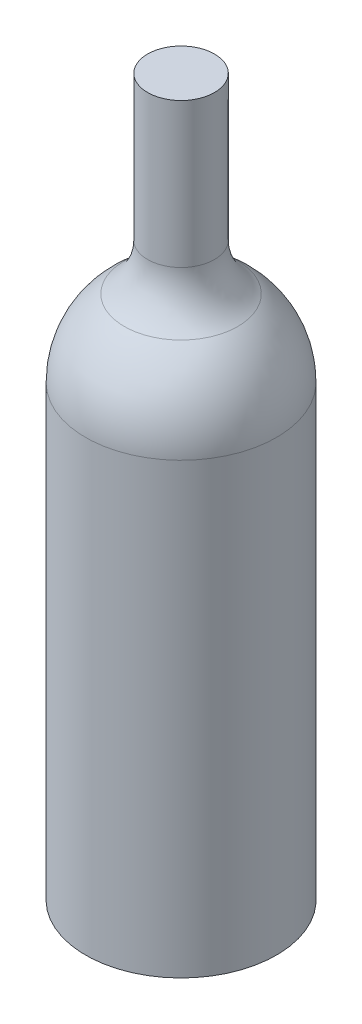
ISO-10303-21;
HEADER;
FILE_DESCRIPTION(('STEP AP214'),'2;1');
FILE_NAME('part.step','',(''),(''),'','','');
FILE_SCHEMA(('AUTOMOTIVE_DESIGN { 1 0 10303 214 1 1 1 1 }'));
ENDSEC;
DATA;
#1=APPLICATION_CONTEXT('core data for automotive mechanical design processes');
#2=APPLICATION_PROTOCOL_DEFINITION('international standard','automotive_design',2000,#1);
#3=PRODUCT_CONTEXT('',#1,'mechanical');
#4=PRODUCT('Part','Part','',(#3));
#5=PRODUCT_RELATED_PRODUCT_CATEGORY('part','',(#4));
#6=PRODUCT_DEFINITION_FORMATION('','',#4);
#7=PRODUCT_DEFINITION_CONTEXT('part definition',#1,'design');
#8=PRODUCT_DEFINITION('design','',#6,#7);
#9=PRODUCT_DEFINITION_SHAPE('','',#8);
#10=(LENGTH_UNIT() NAMED_UNIT(*) SI_UNIT(.MILLI.,.METRE.));
#11=(NAMED_UNIT(*) PLANE_ANGLE_UNIT() SI_UNIT($,.RADIAN.));
#12=(NAMED_UNIT(*) SI_UNIT($,.STERADIAN.) SOLID_ANGLE_UNIT());
#13=UNCERTAINTY_MEASURE_WITH_UNIT(LENGTH_MEASURE(1.E-05),#10,'distance_accuracy_value','');
#14=(GEOMETRIC_REPRESENTATION_CONTEXT(3) GLOBAL_UNCERTAINTY_ASSIGNED_CONTEXT((#13)) GLOBAL_UNIT_ASSIGNED_CONTEXT((#10,
#11,#12)) REPRESENTATION_CONTEXT('',''));
#15=CARTESIAN_POINT('',(0.,0.,0.));
#16=DIRECTION('',(0.,0.,1.));
#17=DIRECTION('',(1.,0.,0.));
#18=AXIS2_PLACEMENT_3D('',#15,#16,#17);
#19=CARTESIAN_POINT('',(40.,0.,0.));
#20=DIRECTION('',(0.,-1.,0.));
#21=DIRECTION('',(0.,0.,-1.));
#22=AXIS2_PLACEMENT_3D('',#19,#20,#21);
#23=PLANE('',#22);
#24=CARTESIAN_POINT('',(0.,0.,0.));
#25=DIRECTION('',(0.,-1.,0.));
#26=DIRECTION('',(0.,0.,-1.));
#27=AXIS2_PLACEMENT_3D('',#24,#25,#26);
#28=CIRCLE('',#27,40.);
#29=CARTESIAN_POINT('',(0.,0.,-40.));
#30=VERTEX_POINT('',#29);
#31=EDGE_CURVE('E10',#30,#30,#28,.T.);
#32=ORIENTED_EDGE('',*,*,#31,.T.);
#33=EDGE_LOOP('',(#32));
#34=FACE_BOUND('',#33,.T.);
#35=ADVANCED_FACE('F346',(#34),#23,.T.);
#36=CARTESIAN_POINT('',(0.,0.,0.));
#37=DIRECTION('',(0.,-1.,0.));
#38=DIRECTION('',(0.,0.,-1.));
#39=AXIS2_PLACEMENT_3D('',#36,#37,#38);
#40=CYLINDRICAL_SURFACE('',#39,40.);
#41=CARTESIAN_POINT('',(0.,187.839329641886,0.));
#42=DIRECTION('',(0.,-1.,0.));
#43=DIRECTION('',(0.,0.,-1.));
#44=AXIS2_PLACEMENT_3D('',#41,#42,#43);
#45=CIRCLE('',#44,40.);
#46=CARTESIAN_POINT('',(0.,187.839329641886,-40.));
#47=VERTEX_POINT('',#46);
#48=EDGE_CURVE('E352',#47,#47,#45,.T.);
#49=ORIENTED_EDGE('',*,*,#48,.T.);
#50=EDGE_LOOP('',(#49));
#51=FACE_BOUND('',#50,.T.);
#52=ORIENTED_EDGE('',*,*,#31,.F.);
#53=EDGE_LOOP('',(#52));
#54=FACE_BOUND('',#53,.T.);
#55=ADVANCED_FACE('F381',(#51,#54),#40,.T.);
#56=CARTESIAN_POINT('',(0.,187.839329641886,0.));
#57=DIRECTION('',(0.,-1.,0.));
#58=DIRECTION('',(1.,0.,0.));
#59=AXIS2_PLACEMENT_3D('',#56,#57,#58);
#60=SPHERICAL_SURFACE('',#59,40.);
#61=CARTESIAN_POINT('',(0.,220.,0.));
#62=DIRECTION('',(0.,-1.,0.));
#63=DIRECTION('',(0.,0.,-1.));
#64=AXIS2_PLACEMENT_3D('',#61,#62,#63);
#65=CIRCLE('',#64,23.7842654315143);
#66=CARTESIAN_POINT('',(0.,220.,-23.7842654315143));
#67=VERTEX_POINT('',#66);
#68=EDGE_CURVE('E356',#67,#67,#65,.T.);
#69=ORIENTED_EDGE('',*,*,#68,.T.);
#70=EDGE_LOOP('',(#69));
#71=FACE_BOUND('',#70,.T.);
#72=ORIENTED_EDGE('',*,*,#48,.F.);
#73=EDGE_LOOP('',(#72));
#74=FACE_BOUND('',#73,.T.);
#75=ADVANCED_FACE('F385',(#71,#74),#60,.T.);
#76=CARTESIAN_POINT('',(0.,239.405136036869,0.));
#77=DIRECTION('',(0.,-1.,0.));
#78=DIRECTION('',(0.,0.,-1.));
#79=AXIS2_PLACEMENT_3D('',#76,#77,#78);
#80=TOROIDAL_SURFACE('',#79,38.13523825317,24.13523825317);
#81=CARTESIAN_POINT('',(0.,239.405136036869,0.));
#82=DIRECTION('',(0.,-1.,0.));
#83=DIRECTION('',(0.,0.,-1.));
#84=AXIS2_PLACEMENT_3D('',#81,#82,#83);
#85=CIRCLE('',#84,14.);
#86=CARTESIAN_POINT('',(0.,239.405136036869,-14.));
#87=VERTEX_POINT('',#86);
#88=EDGE_CURVE('E360',#87,#87,#85,.T.);
#89=ORIENTED_EDGE('',*,*,#88,.T.);
#90=EDGE_LOOP('',(#89));
#91=FACE_BOUND('',#90,.T.);
#92=ORIENTED_EDGE('',*,*,#68,.F.);
#93=EDGE_LOOP('',(#92));
#94=FACE_BOUND('',#93,.T.);
#95=ADVANCED_FACE('F378',(#91,#94),#80,.F.);
#96=CARTESIAN_POINT('',(0.,0.,0.));
#97=DIRECTION('',(0.,-1.,0.));
#98=DIRECTION('',(0.,0.,-1.));
#99=AXIS2_PLACEMENT_3D('',#96,#97,#98);
#100=CYLINDRICAL_SURFACE('',#99,14.);
#101=CARTESIAN_POINT('',(0.,300.,0.));
#102=DIRECTION('',(0.,-1.,0.));
#103=DIRECTION('',(0.,0.,-1.));
#104=AXIS2_PLACEMENT_3D('',#101,#102,#103);
#105=CIRCLE('',#104,14.);
#106=CARTESIAN_POINT('',(0.,300.,-14.));
#107=VERTEX_POINT('',#106);
#108=EDGE_CURVE('E365',#107,#107,#105,.T.);
#109=ORIENTED_EDGE('',*,*,#108,.T.);
#110=EDGE_LOOP('',(#109));
#111=FACE_BOUND('',#110,.T.);
#112=ORIENTED_EDGE('',*,*,#88,.F.);
#113=EDGE_LOOP('',(#112));
#114=FACE_BOUND('',#113,.T.);
#115=ADVANCED_FACE('F369',(#111,#114),#100,.T.);
#116=CARTESIAN_POINT('',(0.,300.,0.));
#117=DIRECTION('',(0.,1.,0.));
#118=DIRECTION('',(0.,0.,1.));
#119=AXIS2_PLACEMENT_3D('',#116,#117,#118);
#120=PLANE('',#119);
#121=ORIENTED_EDGE('',*,*,#108,.F.);
#122=EDGE_LOOP('',(#121));
#123=FACE_BOUND('',#122,.T.);
#124=ADVANCED_FACE('F372',(#123),#120,.T.);
#125=CLOSED_SHELL('',(#35,#55,#75,#95,#115,#124));
#126=MANIFOLD_SOLID_BREP('B2',#125);
#127=ADVANCED_BREP_SHAPE_REPRESENTATION('',(#18,#126),#14);
#128=SHAPE_DEFINITION_REPRESENTATION(#9,#127);
ENDSEC;
END-ISO-10303-21;
